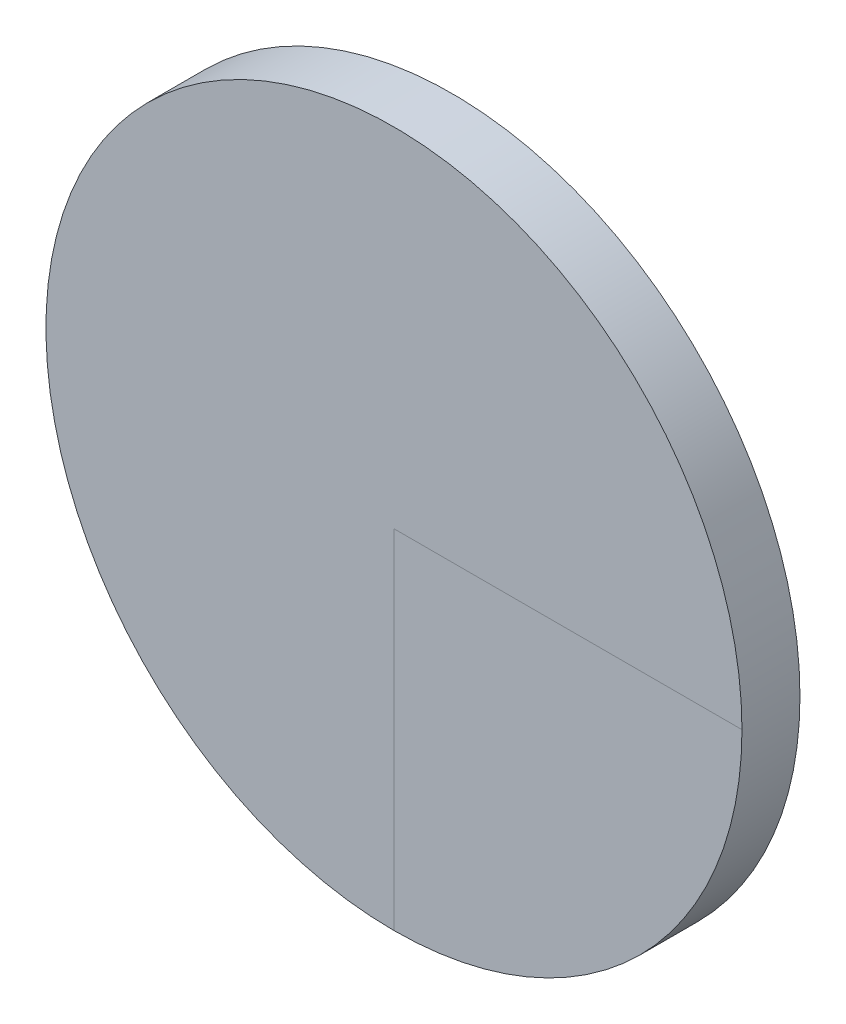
ISO-10303-21;
HEADER;
FILE_DESCRIPTION(('STEP AP214'),'2;1');
FILE_NAME('part.step','',(''),(''),'','','');
FILE_SCHEMA(('AUTOMOTIVE_DESIGN { 1 0 10303 214 1 1 1 1 }'));
ENDSEC;
DATA;
#1=APPLICATION_CONTEXT('core data for automotive mechanical design processes');
#2=APPLICATION_PROTOCOL_DEFINITION('international standard','automotive_design',2000,#1);
#3=PRODUCT_CONTEXT('',#1,'mechanical');
#4=PRODUCT('Part','Part','',(#3));
#5=PRODUCT_RELATED_PRODUCT_CATEGORY('part','',(#4));
#6=PRODUCT_DEFINITION_FORMATION('','',#4);
#7=PRODUCT_DEFINITION_CONTEXT('part definition',#1,'design');
#8=PRODUCT_DEFINITION('design','',#6,#7);
#9=PRODUCT_DEFINITION_SHAPE('','',#8);
#10=(LENGTH_UNIT() NAMED_UNIT(*) SI_UNIT(.MILLI.,.METRE.));
#11=(NAMED_UNIT(*) PLANE_ANGLE_UNIT() SI_UNIT($,.RADIAN.));
#12=(NAMED_UNIT(*) SI_UNIT($,.STERADIAN.) SOLID_ANGLE_UNIT());
#13=UNCERTAINTY_MEASURE_WITH_UNIT(LENGTH_MEASURE(1.E-05),#10,'distance_accuracy_value','');
#14=(GEOMETRIC_REPRESENTATION_CONTEXT(3) GLOBAL_UNCERTAINTY_ASSIGNED_CONTEXT((#13)) GLOBAL_UNIT_ASSIGNED_CONTEXT((#10,
#11,#12)) REPRESENTATION_CONTEXT('',''));
#15=CARTESIAN_POINT('',(0.,0.,0.));
#16=DIRECTION('',(0.,0.,1.));
#17=DIRECTION('',(1.,0.,0.));
#18=AXIS2_PLACEMENT_3D('',#15,#16,#17);
#19=CARTESIAN_POINT('',(0.,0.,0.));
#20=DIRECTION('',(0.,0.,1.));
#21=DIRECTION('',(1.,0.,0.));
#22=AXIS2_PLACEMENT_3D('',#19,#20,#21);
#23=PLANE('',#22);
#24=DIRECTION('',(0.,1.,0.));
#25=VECTOR('',#24,1.);
#26=CARTESIAN_POINT('',(0.,0.,0.));
#27=LINE('',#26,#25);
#28=CARTESIAN_POINT('',(0.,-60.,0.));
#29=VERTEX_POINT('',#28);
#30=CARTESIAN_POINT('',(0.,0.,0.));
#31=VERTEX_POINT('',#30);
#32=EDGE_CURVE('E11',#29,#31,#27,.T.);
#33=ORIENTED_EDGE('',*,*,#32,.F.);
#34=CARTESIAN_POINT('',(0.,0.,0.));
#35=DIRECTION('',(0.,0.,1.));
#36=DIRECTION('',(1.,0.,0.));
#37=AXIS2_PLACEMENT_3D('',#34,#35,#36);
#38=CIRCLE('',#37,60.);
#39=CARTESIAN_POINT('',(60.,0.,0.));
#40=VERTEX_POINT('',#39);
#41=EDGE_CURVE('E86',#40,#29,#38,.T.);
#42=ORIENTED_EDGE('',*,*,#41,.F.);
#43=DIRECTION('',(1.,0.,0.));
#44=VECTOR('',#43,1.);
#45=CARTESIAN_POINT('',(0.,0.,0.));
#46=LINE('',#45,#44);
#47=EDGE_CURVE('E45',#31,#40,#46,.T.);
#48=ORIENTED_EDGE('',*,*,#47,.F.);
#49=EDGE_LOOP('',(#33,#42,#48));
#50=FACE_BOUND('',#49,.T.);
#51=ADVANCED_FACE('F41',(#50),#23,.F.);
#52=CARTESIAN_POINT('',(0.,0.,10.));
#53=DIRECTION('',(0.,0.,1.));
#54=DIRECTION('',(1.,0.,0.));
#55=AXIS2_PLACEMENT_3D('',#52,#53,#54);
#56=PLANE('',#55);
#57=CARTESIAN_POINT('',(0.,0.,10.));
#58=DIRECTION('',(0.,0.,1.));
#59=DIRECTION('',(1.,0.,0.));
#60=AXIS2_PLACEMENT_3D('',#57,#58,#59);
#61=CIRCLE('',#60,60.);
#62=CARTESIAN_POINT('',(60.,0.,10.));
#63=VERTEX_POINT('',#62);
#64=CARTESIAN_POINT('',(0.,-60.,10.));
#65=VERTEX_POINT('',#64);
#66=EDGE_CURVE('E77',#63,#65,#61,.T.);
#67=ORIENTED_EDGE('',*,*,#66,.T.);
#68=DIRECTION('',(0.,1.,0.));
#69=VECTOR('',#68,1.);
#70=CARTESIAN_POINT('',(0.,0.,10.));
#71=LINE('',#70,#69);
#72=CARTESIAN_POINT('',(0.,0.,10.));
#73=VERTEX_POINT('',#72);
#74=EDGE_CURVE('E78',#65,#73,#71,.T.);
#75=ORIENTED_EDGE('',*,*,#74,.T.);
#76=DIRECTION('',(1.,0.,0.));
#77=VECTOR('',#76,1.);
#78=CARTESIAN_POINT('',(0.,0.,10.));
#79=LINE('',#78,#77);
#80=EDGE_CURVE('E73',#73,#63,#79,.T.);
#81=ORIENTED_EDGE('',*,*,#80,.T.);
#82=EDGE_LOOP('',(#67,#75,#81));
#83=FACE_BOUND('',#82,.T.);
#84=ADVANCED_FACE('F75',(#83),#56,.T.);
#85=CARTESIAN_POINT('',(0.,0.,10.));
#86=DIRECTION('',(0.,0.,-1.));
#87=DIRECTION('',(-1.,0.,0.));
#88=AXIS2_PLACEMENT_3D('',#85,#86,#87);
#89=CYLINDRICAL_SURFACE('',#88,60.);
#90=ORIENTED_EDGE('',*,*,#66,.F.);
#91=EDGE_CURVE('E83',#65,#63,#61,.T.);
#92=ORIENTED_EDGE('',*,*,#91,.F.);
#93=EDGE_LOOP('',(#90,#92));
#94=FACE_BOUND('',#93,.T.);
#95=ORIENTED_EDGE('',*,*,#41,.T.);
#96=EDGE_CURVE('E91',#29,#40,#38,.T.);
#97=ORIENTED_EDGE('',*,*,#96,.T.);
#98=EDGE_LOOP('',(#95,#97));
#99=FACE_BOUND('',#98,.T.);
#100=ADVANCED_FACE('F43',(#94,#99),#89,.T.);
#101=ORIENTED_EDGE('',*,*,#74,.F.);
#102=ORIENTED_EDGE('',*,*,#91,.T.);
#103=ORIENTED_EDGE('',*,*,#80,.F.);
#104=EDGE_LOOP('',(#101,#102,#103));
#105=FACE_BOUND('',#104,.T.);
#106=ADVANCED_FACE('F84',(#105),#56,.T.);
#107=ORIENTED_EDGE('',*,*,#96,.F.);
#108=ORIENTED_EDGE('',*,*,#32,.T.);
#109=ORIENTED_EDGE('',*,*,#47,.T.);
#110=EDGE_LOOP('',(#107,#108,#109));
#111=FACE_BOUND('',#110,.T.);
#112=ADVANCED_FACE('F100',(#111),#23,.F.);
#113=CLOSED_SHELL('',(#51,#84,#100,#106,#112));
#114=MANIFOLD_SOLID_BREP('B2',#113);
#115=ADVANCED_BREP_SHAPE_REPRESENTATION('',(#18,#114),#14);
#116=SHAPE_DEFINITION_REPRESENTATION(#9,#115);
ENDSEC;
END-ISO-10303-21;
